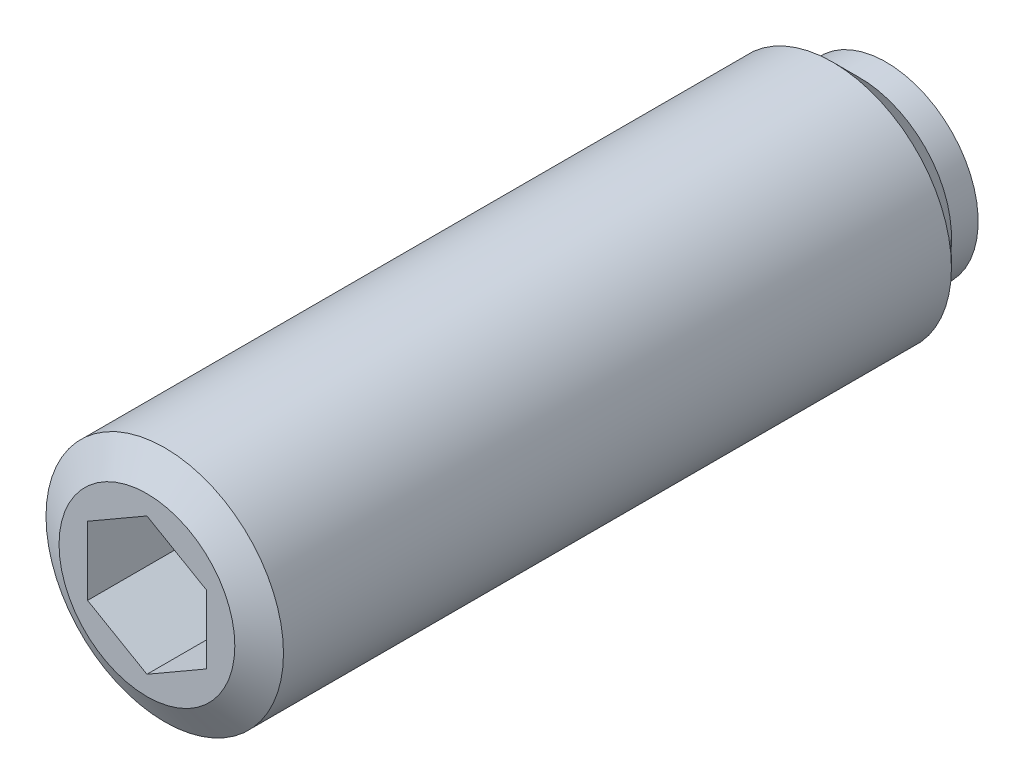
ISO-10303-21;
HEADER;
FILE_DESCRIPTION(('STEP AP214'),'2;1');
FILE_NAME('part.step','',(''),(''),'','','');
FILE_SCHEMA(('AUTOMOTIVE_DESIGN { 1 0 10303 214 1 1 1 1 }'));
ENDSEC;
DATA;
#1=APPLICATION_CONTEXT('core data for automotive mechanical design processes');
#2=APPLICATION_PROTOCOL_DEFINITION('international standard','automotive_design',2000,#1);
#3=PRODUCT_CONTEXT('',#1,'mechanical');
#4=PRODUCT('Part','Part','',(#3));
#5=PRODUCT_RELATED_PRODUCT_CATEGORY('part','',(#4));
#6=PRODUCT_DEFINITION_FORMATION('','',#4);
#7=PRODUCT_DEFINITION_CONTEXT('part definition',#1,'design');
#8=PRODUCT_DEFINITION('design','',#6,#7);
#9=PRODUCT_DEFINITION_SHAPE('','',#8);
#10=(LENGTH_UNIT() NAMED_UNIT(*) SI_UNIT(.MILLI.,.METRE.));
#11=(NAMED_UNIT(*) PLANE_ANGLE_UNIT() SI_UNIT($,.RADIAN.));
#12=(NAMED_UNIT(*) SI_UNIT($,.STERADIAN.) SOLID_ANGLE_UNIT());
#13=UNCERTAINTY_MEASURE_WITH_UNIT(LENGTH_MEASURE(1.E-05),#10,'distance_accuracy_value','');
#14=(GEOMETRIC_REPRESENTATION_CONTEXT(3) GLOBAL_UNCERTAINTY_ASSIGNED_CONTEXT((#13)) GLOBAL_UNIT_ASSIGNED_CONTEXT((#10,
#11,#12)) REPRESENTATION_CONTEXT('',''));
#15=CARTESIAN_POINT('',(0.,0.,0.));
#16=DIRECTION('',(0.,0.,1.));
#17=DIRECTION('',(1.,0.,0.));
#18=AXIS2_PLACEMENT_3D('',#15,#16,#17);
#19=CARTESIAN_POINT('',(0.,2.09621086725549,0.));
#20=DIRECTION('',(0.,0.,1.));
#21=DIRECTION('',(-1.,0.,0.));
#22=AXIS2_PLACEMENT_3D('',#19,#20,#21);
#23=PLANE('',#22);
#24=CARTESIAN_POINT('',(0.,0.,0.));
#25=DIRECTION('',(0.,0.,1.));
#26=DIRECTION('',(-1.,0.,0.));
#27=AXIS2_PLACEMENT_3D('',#24,#25,#26);
#28=CIRCLE('',#27,2.09621086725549);
#29=CARTESIAN_POINT('',(0.,2.09621086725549,0.));
#30=VERTEX_POINT('',#29);
#31=EDGE_CURVE('E9',#30,#30,#28,.T.);
#32=ORIENTED_EDGE('',*,*,#31,.F.);
#33=EDGE_LOOP('',(#32));
#34=FACE_BOUND('',#33,.T.);
#35=ADVANCED_FACE('F14',(#34),#23,.F.);
#36=CARTESIAN_POINT('',(0.,0.,1.78));
#37=DIRECTION('',(0.,0.,1.));
#38=DIRECTION('',(0.,1.,0.));
#39=AXIS2_PLACEMENT_3D('',#36,#37,#38);
#40=SPHERICAL_SURFACE('',#39,2.75);
#41=CARTESIAN_POINT('',(0.,0.,0.5));
#42=DIRECTION('',(0.,0.,1.));
#43=DIRECTION('',(-1.,0.,0.));
#44=AXIS2_PLACEMENT_3D('',#41,#42,#43);
#45=CIRCLE('',#44,2.43394741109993);
#46=CARTESIAN_POINT('',(0.,2.43394741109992,0.5));
#47=VERTEX_POINT('',#46);
#48=EDGE_CURVE('E21',#47,#47,#45,.T.);
#49=CARTESIAN_POINT('',(0.,2.43394741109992,0.5));
#50=CARTESIAN_POINT('',(0.,2.43101603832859,0.494425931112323));
#51=CARTESIAN_POINT('',(0.,2.42806551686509,0.488861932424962));
#52=CARTESIAN_POINT('',(0.,2.42212631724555,0.477754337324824));
#53=CARTESIAN_POINT('',(0.,2.41913763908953,0.472210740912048));
#54=CARTESIAN_POINT('',(0.,2.41312226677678,0.46114421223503));
#55=CARTESIAN_POINT('',(0.,2.41009557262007,0.455621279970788));
#56=CARTESIAN_POINT('',(0.,2.40400431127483,0.444596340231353));
#57=CARTESIAN_POINT('',(0.,2.40093974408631,0.439094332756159));
#58=CARTESIAN_POINT('',(0.,2.39477288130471,0.428111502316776));
#59=CARTESIAN_POINT('',(0.,2.39167058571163,0.422630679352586));
#60=CARTESIAN_POINT('',(0.,2.38542841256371,0.411690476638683));
#61=CARTESIAN_POINT('',(0.,2.38228853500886,0.40623109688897));
#62=CARTESIAN_POINT('',(0.,2.37597134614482,0.39533403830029));
#63=CARTESIAN_POINT('',(0.,2.37279403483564,0.389896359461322));
#64=CARTESIAN_POINT('',(0.,2.36640212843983,0.379042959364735));
#65=CARTESIAN_POINT('',(0.,2.3631875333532,0.373627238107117));
#66=CARTESIAN_POINT('',(0.,2.35672121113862,0.362818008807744));
#67=CARTESIAN_POINT('',(0.,2.35346948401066,0.35742450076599));
#68=CARTESIAN_POINT('',(0.,2.3469290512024,0.346659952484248));
#69=CARTESIAN_POINT('',(0.,2.3436403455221,0.341288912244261));
#70=CARTESIAN_POINT('',(0.,2.3370261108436,0.330569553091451));
#71=CARTESIAN_POINT('',(0.,2.33370058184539,0.325221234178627));
#72=CARTESIAN_POINT('',(0.,2.32701285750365,0.314547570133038));
#73=CARTESIAN_POINT('',(0.,2.32365066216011,0.309222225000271));
#74=CARTESIAN_POINT('',(0.,2.31688976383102,0.298594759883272));
#75=CARTESIAN_POINT('',(0.,2.31349106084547,0.293292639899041));
#76=CARTESIAN_POINT('',(0.,2.30665730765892,0.28271187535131));
#77=CARTESIAN_POINT('',(0.,2.30322225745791,0.277433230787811));
#78=CARTESIAN_POINT('',(0.,2.29631597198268,0.266899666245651));
#79=CARTESIAN_POINT('',(0.,2.29284473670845,0.261644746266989));
#80=CARTESIAN_POINT('',(0.,2.28586624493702,0.251158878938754));
#81=CARTESIAN_POINT('',(0.,2.28235898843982,0.24592793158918));
#82=CARTESIAN_POINT('',(0.,2.27530861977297,0.235490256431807));
#83=CARTESIAN_POINT('',(0.,2.27176550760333,0.230283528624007));
#84=CARTESIAN_POINT('',(0.,2.26464359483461,0.219894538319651));
#85=CARTESIAN_POINT('',(0.,2.26106479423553,0.214712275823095));
#86=CARTESIAN_POINT('',(0.,2.25387167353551,0.204372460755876));
#87=CARTESIAN_POINT('',(0.,2.25025735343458,0.199214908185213));
#88=CARTESIAN_POINT('',(0.,2.24299336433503,0.188924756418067));
#89=CARTESIAN_POINT('',(0.,2.23934369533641,0.183792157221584));
#90=CARTESIAN_POINT('',(0.,2.23200918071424,0.173552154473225));
#91=CARTESIAN_POINT('',(0.,2.22832433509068,0.168444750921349));
#92=CARTESIAN_POINT('',(0.,2.22091964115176,0.158255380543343));
#93=CARTESIAN_POINT('',(0.,2.2171997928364,0.153173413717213));
#94=CARTESIAN_POINT('',(0.,2.20972526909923,0.143035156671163));
#95=CARTESIAN_POINT('',(0.,2.20597059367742,0.137978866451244));
#96=CARTESIAN_POINT('',(0.,2.19842659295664,0.127892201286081));
#97=CARTESIAN_POINT('',(0.,2.19463726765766,0.122861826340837));
#98=CARTESIAN_POINT('',(0.,2.18702414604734,0.112827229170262));
#99=CARTESIAN_POINT('',(0.,2.183200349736,0.10782300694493));
#100=CARTESIAN_POINT('',(0.,2.17551846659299,0.0978409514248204));
#101=CARTESIAN_POINT('',(0.,2.17166037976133,0.0928631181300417));
#102=CARTESIAN_POINT('',(0.,2.16391009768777,0.0829340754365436));
#103=CARTESIAN_POINT('',(0.,2.16001790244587,0.0779828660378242));
#104=CARTESIAN_POINT('',(0.,2.15219958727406,0.0681073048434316));
#105=CARTESIAN_POINT('',(0.,2.14827346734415,0.0631829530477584));
#106=CARTESIAN_POINT('',(0.,2.14038748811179,0.0533613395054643));
#107=CARTESIAN_POINT('',(0.,2.13642762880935,0.0484640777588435));
#108=CARTESIAN_POINT('',(0.,2.12847435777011,0.0386968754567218));
#109=CARTESIAN_POINT('',(0.,2.12448094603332,0.0338269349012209));
#110=CARTESIAN_POINT('',(0.,2.11646075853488,0.024114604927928));
#111=CARTESIAN_POINT('',(0.,2.11243398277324,0.019272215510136));
#112=CARTESIAN_POINT('',(0.,2.10434725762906,0.0096152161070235));
#113=CARTESIAN_POINT('',(0.,2.10028730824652,0.00480060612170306));
#114=CARTESIAN_POINT('',(0.,2.09621086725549,0.));
#115=B_SPLINE_CURVE_WITH_KNOTS('',3,(#49,#50,#51,#52,#53,#54,#55,#56,#57,#58,#59,#60,#61,#62,
#63,#64,#65,#66,#67,#68,#69,#70,#71,#72,#73,#74,#75,#76,#77,#78,#79,#80,#81,#82,#83,#84,#85,#86,
#87,#88,#89,#90,#91,#92,#93,#94,#95,#96,#97,#98,#99,#100,#101,#102,#103,#104,#105,#106,#107,
#108,#109,#110,#111,#112,#113,#114),.UNSPECIFIED.,.F.,.F.,(4,2,2,2,2,2,2,2,2,2,2,2,2,2,2,2,2,2,
2,2,2,2,2,2,2,2,2,2,2,2,2,2,4),(0.,0.0188935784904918,0.0377871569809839,0.0566807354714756,
0.0755743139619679,0.0944678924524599,0.113361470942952,0.132255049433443,0.151148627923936,
0.170042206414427,0.188935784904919,0.207829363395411,0.226722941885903,0.245616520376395,
0.264510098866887,0.283403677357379,0.302297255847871,0.321190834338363,0.340084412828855,
0.358977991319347,0.377871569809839,0.396765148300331,0.415658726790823,0.434552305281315,
0.453445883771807,0.472339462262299,0.491233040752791,0.510126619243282,0.529020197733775,
0.547913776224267,0.566807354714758,0.58570093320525,0.604594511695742),.UNSPECIFIED.);
#116=EDGE_CURVE('BSEAM141',#47,#30,#115,.T.);
#117=ORIENTED_EDGE('',*,*,#48,.F.);
#118=ORIENTED_EDGE('',*,*,#31,.T.);
#119=ORIENTED_EDGE('',*,*,#116,.T.);
#120=ORIENTED_EDGE('',*,*,#116,.F.);
#121=EDGE_LOOP('',(#117,#119,#118,#120));
#122=FACE_BOUND('',#121,.T.);
#123=ADVANCED_FACE('F141',(#122),#40,.T.);
#124=CARTESIAN_POINT('',(0.,3.1,0.5));
#125=DIRECTION('',(0.,0.,1.));
#126=DIRECTION('',(-1.,0.,0.));
#127=AXIS2_PLACEMENT_3D('',#124,#125,#126);
#128=PLANE('',#127);
#129=CARTESIAN_POINT('',(0.,0.,0.5));
#130=DIRECTION('',(0.,0.,1.));
#131=DIRECTION('',(-1.,0.,0.));
#132=AXIS2_PLACEMENT_3D('',#129,#130,#131);
#133=CIRCLE('',#132,3.1);
#134=CARTESIAN_POINT('',(-3.1,0.,0.5));
#135=VERTEX_POINT('',#134);
#136=EDGE_CURVE('E134',#135,#135,#133,.T.);
#137=ORIENTED_EDGE('',*,*,#136,.F.);
#138=EDGE_LOOP('',(#137));
#139=FACE_BOUND('',#138,.T.);
#140=ORIENTED_EDGE('',*,*,#48,.T.);
#141=EDGE_LOOP('',(#140));
#142=FACE_BOUND('',#141,.T.);
#143=ADVANCED_FACE('F139',(#139,#142),#128,.F.);
#144=CARTESIAN_POINT('',(0.,0.,26.7950749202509));
#145=DIRECTION('',(0.,0.,1.));
#146=DIRECTION('',(-1.,0.,0.));
#147=AXIS2_PLACEMENT_3D('',#144,#145,#146);
#148=CYLINDRICAL_SURFACE('',#147,3.1);
#149=CARTESIAN_POINT('',(0.,0.,1.4));
#150=DIRECTION('',(0.,0.,1.));
#151=DIRECTION('',(-1.,0.,0.));
#152=AXIS2_PLACEMENT_3D('',#149,#150,#151);
#153=CIRCLE('',#152,3.1);
#154=CARTESIAN_POINT('',(-3.1,0.,1.4));
#155=VERTEX_POINT('',#154);
#156=EDGE_CURVE('E131',#155,#155,#153,.T.);
#157=ORIENTED_EDGE('',*,*,#156,.F.);
#158=EDGE_LOOP('',(#157));
#159=FACE_BOUND('',#158,.T.);
#160=ORIENTED_EDGE('',*,*,#136,.T.);
#161=EDGE_LOOP('',(#160));
#162=FACE_BOUND('',#161,.T.);
#163=ADVANCED_FACE('F164',(#159,#162),#148,.T.);
#164=CARTESIAN_POINT('',(0.,0.,1.4));
#165=DIRECTION('',(0.,0.,1.));
#166=DIRECTION('',(-1.,0.,0.));
#167=AXIS2_PLACEMENT_3D('',#164,#165,#166);
#168=CONICAL_SURFACE('',#167,3.1,0.785398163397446);
#169=CARTESIAN_POINT('',(0.,0.,2.3));
#170=DIRECTION('',(0.,0.,1.));
#171=DIRECTION('',(-1.,0.,0.));
#172=AXIS2_PLACEMENT_3D('',#169,#170,#171);
#173=CIRCLE('',#172,4.);
#174=CARTESIAN_POINT('',(-4.,0.,2.3));
#175=VERTEX_POINT('',#174);
#176=EDGE_CURVE('E128',#175,#175,#173,.T.);
#177=ORIENTED_EDGE('',*,*,#176,.F.);
#178=EDGE_LOOP('',(#177));
#179=FACE_BOUND('',#178,.T.);
#180=ORIENTED_EDGE('',*,*,#156,.T.);
#181=EDGE_LOOP('',(#180));
#182=FACE_BOUND('',#181,.T.);
#183=ADVANCED_FACE('F173',(#179,#182),#168,.T.);
#184=CARTESIAN_POINT('',(0.,0.,26.7950749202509));
#185=DIRECTION('',(0.,0.,1.));
#186=DIRECTION('',(-1.,0.,0.));
#187=AXIS2_PLACEMENT_3D('',#184,#185,#186);
#188=CYLINDRICAL_SURFACE('',#187,4.);
#189=CARTESIAN_POINT('',(0.,0.,24.8));
#190=DIRECTION('',(0.,0.,1.));
#191=DIRECTION('',(-1.,0.,0.));
#192=AXIS2_PLACEMENT_3D('',#189,#190,#191);
#193=CIRCLE('',#192,4.);
#194=CARTESIAN_POINT('',(-4.,0.,24.8));
#195=VERTEX_POINT('',#194);
#196=EDGE_CURVE('E125',#195,#195,#193,.T.);
#197=ORIENTED_EDGE('',*,*,#196,.F.);
#198=EDGE_LOOP('',(#197));
#199=FACE_BOUND('',#198,.T.);
#200=ORIENTED_EDGE('',*,*,#176,.T.);
#201=EDGE_LOOP('',(#200));
#202=FACE_BOUND('',#201,.T.);
#203=ADVANCED_FACE('F182',(#199,#202),#188,.T.);
#204=CARTESIAN_POINT('',(0.,0.,24.8));
#205=DIRECTION('',(0.,0.,-1.));
#206=DIRECTION('',(1.,0.,0.));
#207=AXIS2_PLACEMENT_3D('',#204,#205,#206);
#208=CONICAL_SURFACE('',#207,4.,1.04719755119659);
#209=CARTESIAN_POINT('',(0.,0.,25.4));
#210=DIRECTION('',(0.,0.,1.));
#211=DIRECTION('',(-1.,0.,0.));
#212=AXIS2_PLACEMENT_3D('',#209,#210,#211);
#213=CIRCLE('',#212,2.96076951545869);
#214=CARTESIAN_POINT('',(-2.96076951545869,0.,25.4));
#215=VERTEX_POINT('',#214);
#216=EDGE_CURVE('E116',#215,#215,#213,.T.);
#217=ORIENTED_EDGE('',*,*,#216,.F.);
#218=EDGE_LOOP('',(#217));
#219=FACE_BOUND('',#218,.T.);
#220=ORIENTED_EDGE('',*,*,#196,.T.);
#221=EDGE_LOOP('',(#220));
#222=FACE_BOUND('',#221,.T.);
#223=ADVANCED_FACE('F191',(#219,#222),#208,.T.);
#224=CARTESIAN_POINT('',(0.,0.,25.4));
#225=DIRECTION('',(0.,0.,-1.));
#226=DIRECTION('',(1.,0.,0.));
#227=AXIS2_PLACEMENT_3D('',#224,#225,#226);
#228=PLANE('',#227);
#229=DIRECTION('',(-0.866025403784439,-0.5,0.));
#230=VECTOR('',#229,1.);
#231=CARTESIAN_POINT('',(0.,2.30940107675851,25.4));
#232=LINE('',#231,#230);
#233=CARTESIAN_POINT('',(0.,2.30940107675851,25.4));
#234=VERTEX_POINT('',#233);
#235=CARTESIAN_POINT('',(-2.,1.15470053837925,25.4));
#236=VERTEX_POINT('',#235);
#237=EDGE_CURVE('E82',#234,#236,#232,.T.);
#238=ORIENTED_EDGE('',*,*,#237,.F.);
#239=DIRECTION('',(-0.866025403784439,0.5,0.));
#240=VECTOR('',#239,1.);
#241=CARTESIAN_POINT('',(2.,1.15470053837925,25.4));
#242=LINE('',#241,#240);
#243=CARTESIAN_POINT('',(2.,1.15470053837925,25.4));
#244=VERTEX_POINT('',#243);
#245=EDGE_CURVE('E28',#244,#234,#242,.T.);
#246=ORIENTED_EDGE('',*,*,#245,.F.);
#247=DIRECTION('',(0.,1.,0.));
#248=VECTOR('',#247,1.);
#249=CARTESIAN_POINT('',(2.,-1.15470053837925,25.4));
#250=LINE('',#249,#248);
#251=CARTESIAN_POINT('',(2.,-1.15470053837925,25.4));
#252=VERTEX_POINT('',#251);
#253=EDGE_CURVE('E98',#252,#244,#250,.T.);
#254=ORIENTED_EDGE('',*,*,#253,.F.);
#255=DIRECTION('',(0.866025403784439,0.5,0.));
#256=VECTOR('',#255,1.);
#257=CARTESIAN_POINT('',(0.,-2.30940107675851,25.4));
#258=LINE('',#257,#256);
#259=CARTESIAN_POINT('',(0.,-2.30940107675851,25.4));
#260=VERTEX_POINT('',#259);
#261=EDGE_CURVE('E92',#260,#252,#258,.T.);
#262=ORIENTED_EDGE('',*,*,#261,.F.);
#263=DIRECTION('',(0.866025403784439,-0.5,0.));
#264=VECTOR('',#263,1.);
#265=CARTESIAN_POINT('',(-2.,-1.15470053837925,25.4));
#266=LINE('',#265,#264);
#267=CARTESIAN_POINT('',(-2.,-1.15470053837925,25.4));
#268=VERTEX_POINT('',#267);
#269=EDGE_CURVE('E90',#268,#260,#266,.T.);
#270=ORIENTED_EDGE('',*,*,#269,.F.);
#271=DIRECTION('',(0.,-1.,0.));
#272=VECTOR('',#271,1.);
#273=CARTESIAN_POINT('',(-2.,1.15470053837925,25.4));
#274=LINE('',#273,#272);
#275=EDGE_CURVE('E71',#236,#268,#274,.T.);
#276=ORIENTED_EDGE('',*,*,#275,.F.);
#277=EDGE_LOOP('',(#238,#246,#254,#262,#270,#276));
#278=FACE_BOUND('',#277,.T.);
#279=ORIENTED_EDGE('',*,*,#216,.T.);
#280=EDGE_LOOP('',(#279));
#281=FACE_BOUND('',#280,.T.);
#282=ADVANCED_FACE('F86',(#278,#281),#228,.F.);
#283=CARTESIAN_POINT('',(2.,1.15470053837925,21.4));
#284=DIRECTION('',(0.5,0.866025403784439,0.));
#285=DIRECTION('',(0.866025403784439,-0.5,0.));
#286=AXIS2_PLACEMENT_3D('',#283,#284,#285);
#287=PLANE('',#286);
#288=ORIENTED_EDGE('',*,*,#245,.T.);
#289=DIRECTION('',(0.,0.,1.));
#290=VECTOR('',#289,1.);
#291=CARTESIAN_POINT('',(0.,2.30940107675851,21.4));
#292=LINE('',#291,#290);
#293=CARTESIAN_POINT('',(0.,2.30940107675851,21.4));
#294=VERTEX_POINT('',#293);
#295=EDGE_CURVE('E79',#294,#234,#292,.T.);
#296=ORIENTED_EDGE('',*,*,#295,.F.);
#297=DIRECTION('',(-0.866025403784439,0.5,0.));
#298=VECTOR('',#297,1.);
#299=CARTESIAN_POINT('',(2.,1.15470053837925,21.4));
#300=LINE('',#299,#298);
#301=CARTESIAN_POINT('',(2.,1.15470053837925,21.4));
#302=VERTEX_POINT('',#301);
#303=EDGE_CURVE('E100',#302,#294,#300,.T.);
#304=ORIENTED_EDGE('',*,*,#303,.F.);
#305=DIRECTION('',(0.,0.,1.));
#306=VECTOR('',#305,1.);
#307=CARTESIAN_POINT('',(2.,1.15470053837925,21.4));
#308=LINE('',#307,#306);
#309=EDGE_CURVE('E35',#302,#244,#308,.T.);
#310=ORIENTED_EDGE('',*,*,#309,.T.);
#311=EDGE_LOOP('',(#288,#296,#304,#310));
#312=FACE_BOUND('',#311,.T.);
#313=ADVANCED_FACE('F208',(#312),#287,.F.);
#314=CARTESIAN_POINT('',(2.,-1.15470053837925,21.4));
#315=DIRECTION('',(1.,0.,0.));
#316=DIRECTION('',(0.,0.,1.));
#317=AXIS2_PLACEMENT_3D('',#314,#315,#316);
#318=PLANE('',#317);
#319=ORIENTED_EDGE('',*,*,#253,.T.);
#320=ORIENTED_EDGE('',*,*,#309,.F.);
#321=DIRECTION('',(0.,1.,0.));
#322=VECTOR('',#321,1.);
#323=CARTESIAN_POINT('',(2.,-1.15470053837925,21.4));
#324=LINE('',#323,#322);
#325=CARTESIAN_POINT('',(2.,-1.15470053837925,21.4));
#326=VERTEX_POINT('',#325);
#327=EDGE_CURVE('E112',#326,#302,#324,.T.);
#328=ORIENTED_EDGE('',*,*,#327,.F.);
#329=DIRECTION('',(0.,0.,1.));
#330=VECTOR('',#329,1.);
#331=CARTESIAN_POINT('',(2.,-1.15470053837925,21.4));
#332=LINE('',#331,#330);
#333=EDGE_CURVE('E117',#326,#252,#332,.T.);
#334=ORIENTED_EDGE('',*,*,#333,.T.);
#335=EDGE_LOOP('',(#319,#320,#328,#334));
#336=FACE_BOUND('',#335,.T.);
#337=ADVANCED_FACE('F216',(#336),#318,.F.);
#338=CARTESIAN_POINT('',(0.,-2.30940107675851,21.4));
#339=DIRECTION('',(0.5,-0.866025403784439,0.));
#340=DIRECTION('',(-0.866025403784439,-0.5,0.));
#341=AXIS2_PLACEMENT_3D('',#338,#339,#340);
#342=PLANE('',#341);
#343=ORIENTED_EDGE('',*,*,#261,.T.);
#344=ORIENTED_EDGE('',*,*,#333,.F.);
#345=DIRECTION('',(0.866025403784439,0.5,0.));
#346=VECTOR('',#345,1.);
#347=CARTESIAN_POINT('',(0.,-2.30940107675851,21.4));
#348=LINE('',#347,#346);
#349=CARTESIAN_POINT('',(0.,-2.30940107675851,21.4));
#350=VERTEX_POINT('',#349);
#351=EDGE_CURVE('E109',#350,#326,#348,.T.);
#352=ORIENTED_EDGE('',*,*,#351,.F.);
#353=DIRECTION('',(0.,0.,1.));
#354=VECTOR('',#353,1.);
#355=CARTESIAN_POINT('',(0.,-2.30940107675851,21.4));
#356=LINE('',#355,#354);
#357=EDGE_CURVE('E119',#350,#260,#356,.T.);
#358=ORIENTED_EDGE('',*,*,#357,.T.);
#359=EDGE_LOOP('',(#343,#344,#352,#358));
#360=FACE_BOUND('',#359,.T.);
#361=ADVANCED_FACE('F224',(#360),#342,.F.);
#362=CARTESIAN_POINT('',(-2.,-1.15470053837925,21.4));
#363=DIRECTION('',(-0.5,-0.866025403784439,0.));
#364=DIRECTION('',(-0.866025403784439,0.5,0.));
#365=AXIS2_PLACEMENT_3D('',#362,#363,#364);
#366=PLANE('',#365);
#367=ORIENTED_EDGE('',*,*,#269,.T.);
#368=ORIENTED_EDGE('',*,*,#357,.F.);
#369=DIRECTION('',(0.866025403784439,-0.5,0.));
#370=VECTOR('',#369,1.);
#371=CARTESIAN_POINT('',(-2.,-1.15470053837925,21.4));
#372=LINE('',#371,#370);
#373=CARTESIAN_POINT('',(-2.,-1.15470053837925,21.4));
#374=VERTEX_POINT('',#373);
#375=EDGE_CURVE('E106',#374,#350,#372,.T.);
#376=ORIENTED_EDGE('',*,*,#375,.F.);
#377=DIRECTION('',(0.,0.,1.));
#378=VECTOR('',#377,1.);
#379=CARTESIAN_POINT('',(-2.,-1.15470053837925,21.4));
#380=LINE('',#379,#378);
#381=EDGE_CURVE('E78',#374,#268,#380,.T.);
#382=ORIENTED_EDGE('',*,*,#381,.T.);
#383=EDGE_LOOP('',(#367,#368,#376,#382));
#384=FACE_BOUND('',#383,.T.);
#385=ADVANCED_FACE('F232',(#384),#366,.F.);
#386=CARTESIAN_POINT('',(-2.,1.15470053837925,21.4));
#387=DIRECTION('',(-1.,0.,0.));
#388=DIRECTION('',(0.,1.,0.));
#389=AXIS2_PLACEMENT_3D('',#386,#387,#388);
#390=PLANE('',#389);
#391=ORIENTED_EDGE('',*,*,#275,.T.);
#392=ORIENTED_EDGE('',*,*,#381,.F.);
#393=DIRECTION('',(0.,-1.,0.));
#394=VECTOR('',#393,1.);
#395=CARTESIAN_POINT('',(-2.,1.15470053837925,21.4));
#396=LINE('',#395,#394);
#397=CARTESIAN_POINT('',(-2.,1.15470053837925,21.4));
#398=VERTEX_POINT('',#397);
#399=EDGE_CURVE('E74',#398,#374,#396,.T.);
#400=ORIENTED_EDGE('',*,*,#399,.F.);
#401=DIRECTION('',(0.,0.,1.));
#402=VECTOR('',#401,1.);
#403=CARTESIAN_POINT('',(-2.,1.15470053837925,21.4));
#404=LINE('',#403,#402);
#405=EDGE_CURVE('E67',#398,#236,#404,.T.);
#406=ORIENTED_EDGE('',*,*,#405,.T.);
#407=EDGE_LOOP('',(#391,#392,#400,#406));
#408=FACE_BOUND('',#407,.T.);
#409=ADVANCED_FACE('F69',(#408),#390,.F.);
#410=CARTESIAN_POINT('',(0.,2.30940107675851,21.4));
#411=DIRECTION('',(-0.5,0.866025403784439,0.));
#412=DIRECTION('',(0.866025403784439,0.5,0.));
#413=AXIS2_PLACEMENT_3D('',#410,#411,#412);
#414=PLANE('',#413);
#415=ORIENTED_EDGE('',*,*,#237,.T.);
#416=ORIENTED_EDGE('',*,*,#405,.F.);
#417=DIRECTION('',(-0.866025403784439,-0.5,0.));
#418=VECTOR('',#417,1.);
#419=CARTESIAN_POINT('',(0.,2.30940107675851,21.4));
#420=LINE('',#419,#418);
#421=EDGE_CURVE('E103',#294,#398,#420,.T.);
#422=ORIENTED_EDGE('',*,*,#421,.F.);
#423=ORIENTED_EDGE('',*,*,#295,.T.);
#424=EDGE_LOOP('',(#415,#416,#422,#423));
#425=FACE_BOUND('',#424,.T.);
#426=ADVANCED_FACE('F83',(#425),#414,.F.);
#427=CARTESIAN_POINT('',(2.,1.15470053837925,21.4));
#428=DIRECTION('',(0.,0.,-1.));
#429=DIRECTION('',(1.,0.,0.));
#430=AXIS2_PLACEMENT_3D('',#427,#428,#429);
#431=PLANE('',#430);
#432=ORIENTED_EDGE('',*,*,#303,.T.);
#433=ORIENTED_EDGE('',*,*,#421,.T.);
#434=ORIENTED_EDGE('',*,*,#399,.T.);
#435=ORIENTED_EDGE('',*,*,#375,.T.);
#436=ORIENTED_EDGE('',*,*,#351,.T.);
#437=ORIENTED_EDGE('',*,*,#327,.T.);
#438=EDGE_LOOP('',(#432,#433,#434,#435,#436,#437));
#439=FACE_BOUND('',#438,.T.);
#440=ADVANCED_FACE('F256',(#439),#431,.F.);
#441=CLOSED_SHELL('',(#35,#123,#143,#163,#183,#203,#223,#282,#313,#337,#361,#385,#409,#426,#440));
#442=MANIFOLD_SOLID_BREP('B1',#441);
#443=ADVANCED_BREP_SHAPE_REPRESENTATION('',(#18,#442),#14);
#444=SHAPE_DEFINITION_REPRESENTATION(#9,#443);
ENDSEC;
END-ISO-10303-21;
